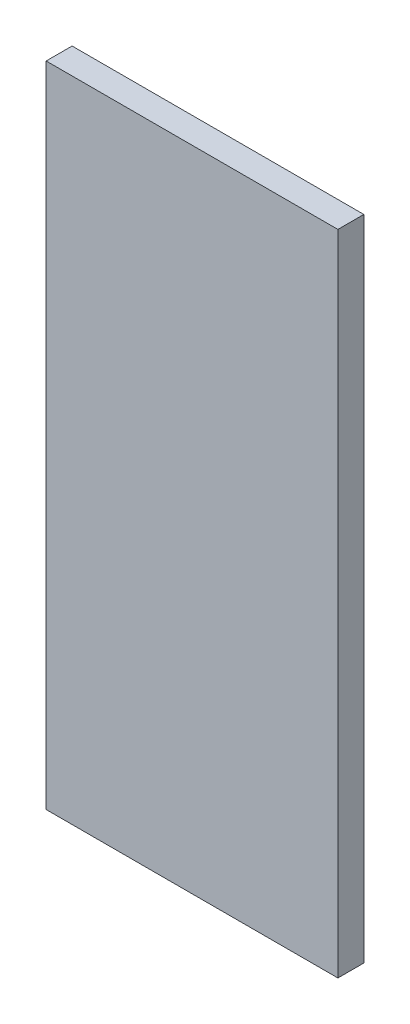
from build123d import *

# Parameters (mm, degrees)
SKETCH_1_W      = 90
SKETCH_1_H      = 200
EXTRUDE_1_DEPTH = 8


with BuildPart() as part:
    # Sketch 1 → Extrude 1 (new body)
    with BuildSketch(Plane.XY):
        with Locations((45, 100)):
            Rectangle(SKETCH_1_W, SKETCH_1_H)
    extrude(amount=EXTRUDE_1_DEPTH)


solid = part.part
